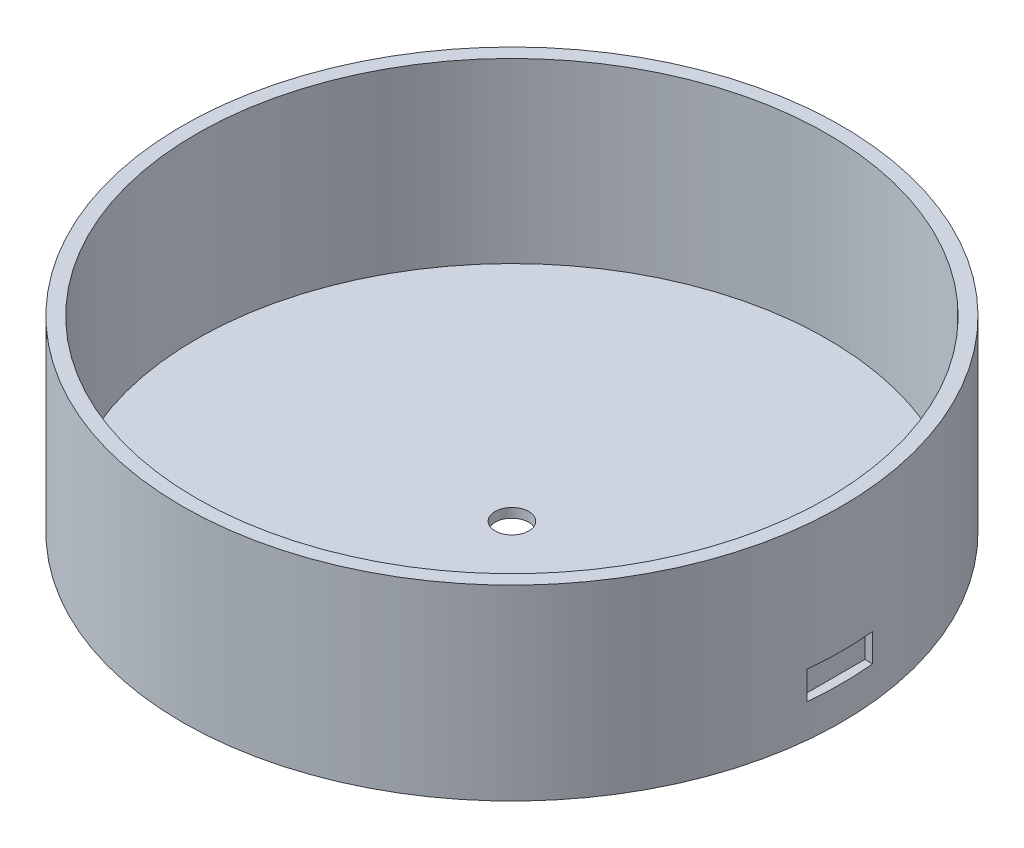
from build123d import *

# Parameters (mm, degrees)
SKMAINSKETCH_R         = 67.5
SKMAINSKETCH_R_2       = 3.6
FLOORDISKANDHOLE_DEPTH = 2
SKETCH1_3_R            = 70.5
SKETCH1_3_R_2          = 67.5
WALL_DEPTH             = 40
SKETCH3_W              = 14
SKETCH3_H              = 6
CUT_EXTRUDE3_DEPTH     = 2


with BuildPart() as part:
    # skMainSketch → FloorDiskAndHole (new body)
    with BuildSketch(Plane(origin=(0, 0, 0), x_dir=(1, 0, 0), z_dir=(0, 1, 0))):
        with Locations(Location((0, 0, 0), (0, 0, 270))):
            Circle(SKMAINSKETCH_R)
        with Locations(Location((0, 0, 0), (0, 0, 270))):
            Circle(SKMAINSKETCH_R_2, mode=Mode.SUBTRACT)
    extrude(amount=FLOORDISKANDHOLE_DEPTH)

    # Sketch1_3 → Wall (add)
    with BuildSketch(Plane(origin=(0, 0, 0), x_dir=(1, 0, 0), z_dir=(0, 1, 0))):
        with Locations(Location((0, 0, 0), (0, 0, 270))):
            Circle(SKETCH1_3_R)
        with Locations(Location((0, 0, 0), (0, 0, 270))):
            Circle(SKETCH1_3_R_2, mode=Mode.SUBTRACT)
    extrude(amount=WALL_DEPTH)

    # Sketch3 → Cut-Extrude3 (cut)
    with BuildSketch(Plane(origin=(70.5, 0, 0), x_dir=(0, 0, -1), z_dir=(1, 0, 0))):
        with Locations((0, 10.14)):
            Rectangle(SKETCH3_W, SKETCH3_H)
    cut_extrude3 = extrude(amount=-CUT_EXTRUDE3_DEPTH, mode=Mode.SUBTRACT)

    # Mirror1: Cut-Extrude3 across plane
    add(cut_extrude3.mirror(Plane(origin=(0, 0, 0), x_dir=(0, 0, 1), z_dir=(1, 0, 0))), mode=Mode.SUBTRACT)


solid = part.part
